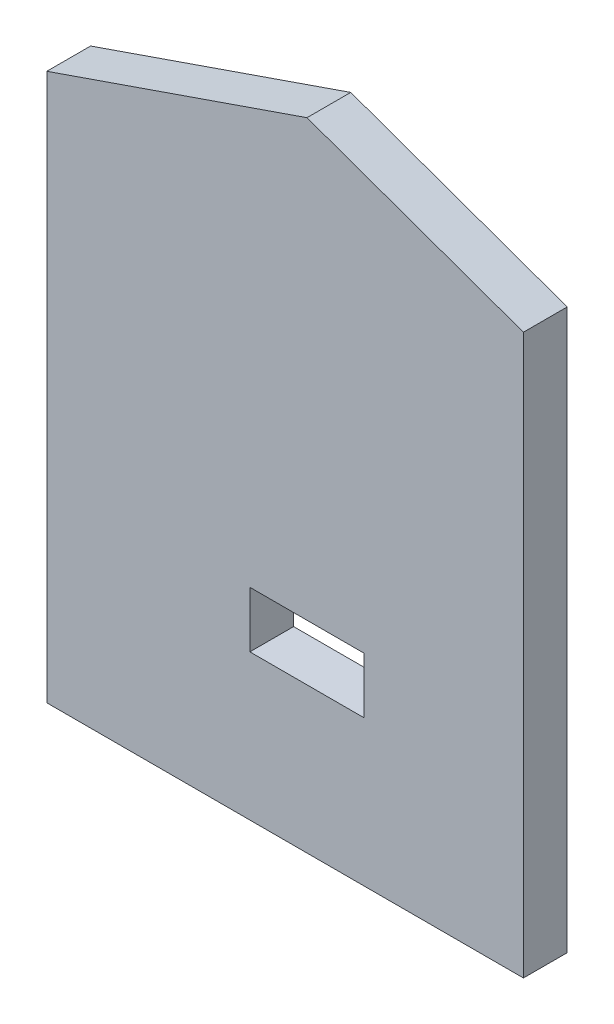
ISO-10303-21;
HEADER;
FILE_DESCRIPTION(('STEP AP214'),'2;1');
FILE_NAME('part.step','',(''),(''),'','','');
FILE_SCHEMA(('AUTOMOTIVE_DESIGN { 1 0 10303 214 1 1 1 1 }'));
ENDSEC;
DATA;
#1=APPLICATION_CONTEXT('core data for automotive mechanical design processes');
#2=APPLICATION_PROTOCOL_DEFINITION('international standard','automotive_design',2000,#1);
#3=PRODUCT_CONTEXT('',#1,'mechanical');
#4=PRODUCT('Part','Part','',(#3));
#5=PRODUCT_RELATED_PRODUCT_CATEGORY('part','',(#4));
#6=PRODUCT_DEFINITION_FORMATION('','',#4);
#7=PRODUCT_DEFINITION_CONTEXT('part definition',#1,'design');
#8=PRODUCT_DEFINITION('design','',#6,#7);
#9=PRODUCT_DEFINITION_SHAPE('','',#8);
#10=(LENGTH_UNIT() NAMED_UNIT(*) SI_UNIT(.MILLI.,.METRE.));
#11=(NAMED_UNIT(*) PLANE_ANGLE_UNIT() SI_UNIT($,.RADIAN.));
#12=(NAMED_UNIT(*) SI_UNIT($,.STERADIAN.) SOLID_ANGLE_UNIT());
#13=UNCERTAINTY_MEASURE_WITH_UNIT(LENGTH_MEASURE(1.E-05),#10,'distance_accuracy_value','');
#14=(GEOMETRIC_REPRESENTATION_CONTEXT(3) GLOBAL_UNCERTAINTY_ASSIGNED_CONTEXT((#13)) GLOBAL_UNIT_ASSIGNED_CONTEXT((#10,
#11,#12)) REPRESENTATION_CONTEXT('',''));
#15=CARTESIAN_POINT('',(0.,0.,0.));
#16=DIRECTION('',(0.,0.,1.));
#17=DIRECTION('',(1.,0.,0.));
#18=AXIS2_PLACEMENT_3D('',#15,#16,#17);
#19=CARTESIAN_POINT('',(0.,82.9046513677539,18.));
#20=DIRECTION('',(0.,1.,0.));
#21=DIRECTION('',(0.,0.,1.));
#22=AXIS2_PLACEMENT_3D('',#19,#20,#21);
#23=PLANE('',#22);
#24=DIRECTION('',(1.,0.,0.));
#25=VECTOR('',#24,1.);
#26=CARTESIAN_POINT('',(0.,82.9046513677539,0.));
#27=LINE('',#26,#25);
#28=CARTESIAN_POINT('',(83.5,82.9046513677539,0.));
#29=VERTEX_POINT('',#28);
#30=CARTESIAN_POINT('',(130.5,82.9046513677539,0.));
#31=VERTEX_POINT('',#30);
#32=EDGE_CURVE('E149',#29,#31,#27,.T.);
#33=ORIENTED_EDGE('',*,*,#32,.T.);
#34=DIRECTION('',(0.,0.,-1.));
#35=VECTOR('',#34,1.);
#36=CARTESIAN_POINT('',(130.5,82.9046513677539,18.));
#37=LINE('',#36,#35);
#38=CARTESIAN_POINT('',(130.5,82.9046513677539,18.));
#39=VERTEX_POINT('',#38);
#40=EDGE_CURVE('E11',#39,#31,#37,.T.);
#41=ORIENTED_EDGE('',*,*,#40,.F.);
#42=DIRECTION('',(1.,0.,0.));
#43=VECTOR('',#42,1.);
#44=CARTESIAN_POINT('',(0.,82.9046513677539,18.));
#45=LINE('',#44,#43);
#46=CARTESIAN_POINT('',(83.5,82.9046513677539,18.));
#47=VERTEX_POINT('',#46);
#48=EDGE_CURVE('E121',#47,#39,#45,.T.);
#49=ORIENTED_EDGE('',*,*,#48,.F.);
#50=DIRECTION('',(0.,0.,-1.));
#51=VECTOR('',#50,1.);
#52=CARTESIAN_POINT('',(83.5,82.9046513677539,18.));
#53=LINE('',#52,#51);
#54=EDGE_CURVE('E54',#47,#29,#53,.T.);
#55=ORIENTED_EDGE('',*,*,#54,.T.);
#56=EDGE_LOOP('',(#33,#41,#49,#55));
#57=FACE_BOUND('',#56,.T.);
#58=ADVANCED_FACE('F35',(#57),#23,.F.);
#59=CARTESIAN_POINT('',(130.5,0.,18.));
#60=DIRECTION('',(1.,0.,0.));
#61=DIRECTION('',(0.,0.,-1.));
#62=AXIS2_PLACEMENT_3D('',#59,#60,#61);
#63=PLANE('',#62);
#64=DIRECTION('',(0.,-1.,0.));
#65=VECTOR('',#64,1.);
#66=CARTESIAN_POINT('',(130.5,0.,0.));
#67=LINE('',#66,#65);
#68=CARTESIAN_POINT('',(130.5,59.9046513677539,0.));
#69=VERTEX_POINT('',#68);
#70=EDGE_CURVE('E127',#31,#69,#67,.T.);
#71=ORIENTED_EDGE('',*,*,#70,.T.);
#72=DIRECTION('',(0.,0.,-1.));
#73=VECTOR('',#72,1.);
#74=CARTESIAN_POINT('',(130.5,59.9046513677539,18.));
#75=LINE('',#74,#73);
#76=CARTESIAN_POINT('',(130.5,59.9046513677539,18.));
#77=VERTEX_POINT('',#76);
#78=EDGE_CURVE('E45',#77,#69,#75,.T.);
#79=ORIENTED_EDGE('',*,*,#78,.F.);
#80=DIRECTION('',(0.,-1.,0.));
#81=VECTOR('',#80,1.);
#82=CARTESIAN_POINT('',(130.5,0.,18.));
#83=LINE('',#82,#81);
#84=EDGE_CURVE('E115',#39,#77,#83,.T.);
#85=ORIENTED_EDGE('',*,*,#84,.F.);
#86=ORIENTED_EDGE('',*,*,#40,.T.);
#87=EDGE_LOOP('',(#71,#79,#85,#86));
#88=FACE_BOUND('',#87,.T.);
#89=ADVANCED_FACE('F126',(#88),#63,.F.);
#90=CARTESIAN_POINT('',(0.,59.9046513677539,18.));
#91=DIRECTION('',(0.,1.,0.));
#92=DIRECTION('',(0.,0.,1.));
#93=AXIS2_PLACEMENT_3D('',#90,#91,#92);
#94=PLANE('',#93);
#95=DIRECTION('',(1.,0.,0.));
#96=VECTOR('',#95,1.);
#97=CARTESIAN_POINT('',(0.,59.9046513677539,0.));
#98=LINE('',#97,#96);
#99=CARTESIAN_POINT('',(83.5000000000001,59.9046513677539,0.));
#100=VERTEX_POINT('',#99);
#101=EDGE_CURVE('E152',#100,#69,#98,.T.);
#102=ORIENTED_EDGE('',*,*,#101,.F.);
#103=DIRECTION('',(0.,0.,-1.));
#104=VECTOR('',#103,1.);
#105=CARTESIAN_POINT('',(83.5000000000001,59.9046513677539,18.));
#106=LINE('',#105,#104);
#107=CARTESIAN_POINT('',(83.5000000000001,59.9046513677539,18.));
#108=VERTEX_POINT('',#107);
#109=EDGE_CURVE('E83',#108,#100,#106,.T.);
#110=ORIENTED_EDGE('',*,*,#109,.F.);
#111=DIRECTION('',(1.,0.,0.));
#112=VECTOR('',#111,1.);
#113=CARTESIAN_POINT('',(0.,59.9046513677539,18.));
#114=LINE('',#113,#112);
#115=EDGE_CURVE('E120',#108,#77,#114,.T.);
#116=ORIENTED_EDGE('',*,*,#115,.T.);
#117=ORIENTED_EDGE('',*,*,#78,.T.);
#118=EDGE_LOOP('',(#102,#110,#116,#117));
#119=FACE_BOUND('',#118,.T.);
#120=ADVANCED_FACE('F131',(#119),#94,.T.);
#121=CARTESIAN_POINT('',(-69.4350127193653,200.936211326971,18.));
#122=DIRECTION('',(0.326607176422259,-0.94516017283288,0.));
#123=DIRECTION('',(0.94516017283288,0.32660717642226,0.));
#124=AXIS2_PLACEMENT_3D('',#121,#122,#123);
#125=PLANE('',#124);
#126=DIRECTION('',(-0.94516017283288,-0.32660717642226,0.));
#127=VECTOR('',#126,1.);
#128=CARTESIAN_POINT('',(-69.4350127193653,200.936211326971,0.));
#129=LINE('',#128,#127);
#130=CARTESIAN_POINT('',(107.,261.904651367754,0.));
#131=VERTEX_POINT('',#130);
#132=CARTESIAN_POINT('',(0.,224.93,0.));
#133=VERTEX_POINT('',#132);
#134=EDGE_CURVE('E138',#131,#133,#129,.T.);
#135=ORIENTED_EDGE('',*,*,#134,.T.);
#136=DIRECTION('',(0.,0.,-1.));
#137=VECTOR('',#136,1.);
#138=CARTESIAN_POINT('',(0.,224.93,18.));
#139=LINE('',#138,#137);
#140=CARTESIAN_POINT('',(0.,224.93,18.));
#141=VERTEX_POINT('',#140);
#142=EDGE_CURVE('E39',#141,#133,#139,.T.);
#143=ORIENTED_EDGE('',*,*,#142,.F.);
#144=DIRECTION('',(-0.94516017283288,-0.32660717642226,0.));
#145=VECTOR('',#144,1.);
#146=CARTESIAN_POINT('',(-69.4350127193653,200.936211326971,18.));
#147=LINE('',#146,#145);
#148=CARTESIAN_POINT('',(107.,261.904651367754,18.));
#149=VERTEX_POINT('',#148);
#150=EDGE_CURVE('E157',#149,#141,#147,.T.);
#151=ORIENTED_EDGE('',*,*,#150,.F.);
#152=DIRECTION('',(0.,0.,-1.));
#153=VECTOR('',#152,1.);
#154=CARTESIAN_POINT('',(107.,261.904651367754,18.));
#155=LINE('',#154,#153);
#156=EDGE_CURVE('E134',#149,#131,#155,.T.);
#157=ORIENTED_EDGE('',*,*,#156,.T.);
#158=EDGE_LOOP('',(#135,#143,#151,#157));
#159=FACE_BOUND('',#158,.T.);
#160=ADVANCED_FACE('F37',(#159),#125,.F.);
#161=CARTESIAN_POINT('',(0.,0.,18.));
#162=DIRECTION('',(1.,0.,0.));
#163=DIRECTION('',(0.,1.,0.));
#164=AXIS2_PLACEMENT_3D('',#161,#162,#163);
#165=PLANE('',#164);
#166=DIRECTION('',(0.,-1.,0.));
#167=VECTOR('',#166,1.);
#168=CARTESIAN_POINT('',(0.,0.,0.));
#169=LINE('',#168,#167);
#170=CARTESIAN_POINT('',(0.,0.,0.));
#171=VERTEX_POINT('',#170);
#172=EDGE_CURVE('E141',#133,#171,#169,.T.);
#173=ORIENTED_EDGE('',*,*,#172,.T.);
#174=DIRECTION('',(0.,0.,-1.));
#175=VECTOR('',#174,1.);
#176=CARTESIAN_POINT('',(0.,0.,18.));
#177=LINE('',#176,#175);
#178=CARTESIAN_POINT('',(0.,0.,18.));
#179=VERTEX_POINT('',#178);
#180=EDGE_CURVE('E167',#179,#171,#177,.T.);
#181=ORIENTED_EDGE('',*,*,#180,.F.);
#182=DIRECTION('',(0.,-1.,0.));
#183=VECTOR('',#182,1.);
#184=CARTESIAN_POINT('',(0.,0.,18.));
#185=LINE('',#184,#183);
#186=EDGE_CURVE('E96',#141,#179,#185,.T.);
#187=ORIENTED_EDGE('',*,*,#186,.F.);
#188=ORIENTED_EDGE('',*,*,#142,.T.);
#189=EDGE_LOOP('',(#173,#181,#187,#188));
#190=FACE_BOUND('',#189,.T.);
#191=ADVANCED_FACE('F173',(#190),#165,.F.);
#192=CARTESIAN_POINT('',(0.,0.,18.));
#193=DIRECTION('',(0.,1.,0.));
#194=DIRECTION('',(0.,0.,1.));
#195=AXIS2_PLACEMENT_3D('',#192,#193,#194);
#196=PLANE('',#195);
#197=DIRECTION('',(1.,0.,0.));
#198=VECTOR('',#197,1.);
#199=CARTESIAN_POINT('',(0.,0.,0.));
#200=LINE('',#199,#198);
#201=CARTESIAN_POINT('',(196.,0.,0.));
#202=VERTEX_POINT('',#201);
#203=EDGE_CURVE('E143',#171,#202,#200,.T.);
#204=ORIENTED_EDGE('',*,*,#203,.T.);
#205=DIRECTION('',(0.,0.,-1.));
#206=VECTOR('',#205,1.);
#207=CARTESIAN_POINT('',(196.,0.,18.));
#208=LINE('',#207,#206);
#209=CARTESIAN_POINT('',(196.,0.,18.));
#210=VERTEX_POINT('',#209);
#211=EDGE_CURVE('E165',#210,#202,#208,.T.);
#212=ORIENTED_EDGE('',*,*,#211,.F.);
#213=DIRECTION('',(1.,0.,0.));
#214=VECTOR('',#213,1.);
#215=CARTESIAN_POINT('',(0.,0.,18.));
#216=LINE('',#215,#214);
#217=EDGE_CURVE('E193',#179,#210,#216,.T.);
#218=ORIENTED_EDGE('',*,*,#217,.F.);
#219=ORIENTED_EDGE('',*,*,#180,.T.);
#220=EDGE_LOOP('',(#204,#212,#218,#219));
#221=FACE_BOUND('',#220,.T.);
#222=ADVANCED_FACE('F184',(#221),#196,.F.);
#223=CARTESIAN_POINT('',(196.,0.,18.));
#224=DIRECTION('',(-1.,0.,0.));
#225=DIRECTION('',(0.,0.,1.));
#226=AXIS2_PLACEMENT_3D('',#223,#224,#225);
#227=PLANE('',#226);
#228=DIRECTION('',(0.,1.,0.));
#229=VECTOR('',#228,1.);
#230=CARTESIAN_POINT('',(196.,0.,0.));
#231=LINE('',#230,#229);
#232=CARTESIAN_POINT('',(196.,230.,0.));
#233=VERTEX_POINT('',#232);
#234=EDGE_CURVE('E145',#202,#233,#231,.T.);
#235=ORIENTED_EDGE('',*,*,#234,.T.);
#236=DIRECTION('',(0.,0.,-1.));
#237=VECTOR('',#236,1.);
#238=CARTESIAN_POINT('',(196.,230.,18.));
#239=LINE('',#238,#237);
#240=CARTESIAN_POINT('',(196.,230.,18.));
#241=VERTEX_POINT('',#240);
#242=EDGE_CURVE('E162',#241,#233,#239,.T.);
#243=ORIENTED_EDGE('',*,*,#242,.F.);
#244=DIRECTION('',(0.,1.,0.));
#245=VECTOR('',#244,1.);
#246=CARTESIAN_POINT('',(196.,0.,18.));
#247=LINE('',#246,#245);
#248=EDGE_CURVE('E189',#210,#241,#247,.T.);
#249=ORIENTED_EDGE('',*,*,#248,.F.);
#250=ORIENTED_EDGE('',*,*,#211,.T.);
#251=EDGE_LOOP('',(#235,#243,#249,#250));
#252=FACE_BOUND('',#251,.T.);
#253=ADVANCED_FACE('F187',(#252),#227,.F.);
#254=CARTESIAN_POINT('',(95.3805608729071,266.069978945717,18.));
#255=DIRECTION('',(-0.337451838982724,-0.941342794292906,0.));
#256=DIRECTION('',(0.941342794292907,-0.337451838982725,0.));
#257=AXIS2_PLACEMENT_3D('',#254,#255,#256);
#258=PLANE('',#257);
#259=DIRECTION('',(-0.941342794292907,0.337451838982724,0.));
#260=VECTOR('',#259,1.);
#261=CARTESIAN_POINT('',(95.3805608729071,266.069978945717,0.));
#262=LINE('',#261,#260);
#263=EDGE_CURVE('E147',#233,#131,#262,.T.);
#264=ORIENTED_EDGE('',*,*,#263,.T.);
#265=ORIENTED_EDGE('',*,*,#156,.F.);
#266=DIRECTION('',(-0.941342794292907,0.337451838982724,0.));
#267=VECTOR('',#266,1.);
#268=CARTESIAN_POINT('',(95.3805608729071,266.069978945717,18.));
#269=LINE('',#268,#267);
#270=EDGE_CURVE('E192',#241,#149,#269,.T.);
#271=ORIENTED_EDGE('',*,*,#270,.F.);
#272=ORIENTED_EDGE('',*,*,#242,.T.);
#273=EDGE_LOOP('',(#264,#265,#271,#272));
#274=FACE_BOUND('',#273,.T.);
#275=ADVANCED_FACE('F200',(#274),#258,.F.);
#276=CARTESIAN_POINT('',(83.5000000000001,0.,18.));
#277=DIRECTION('',(1.,0.,0.));
#278=DIRECTION('',(0.,1.,0.));
#279=AXIS2_PLACEMENT_3D('',#276,#277,#278);
#280=PLANE('',#279);
#281=DIRECTION('',(0.,-1.,0.));
#282=VECTOR('',#281,1.);
#283=CARTESIAN_POINT('',(83.5000000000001,0.,0.));
#284=LINE('',#283,#282);
#285=EDGE_CURVE('E154',#29,#100,#284,.T.);
#286=ORIENTED_EDGE('',*,*,#285,.F.);
#287=ORIENTED_EDGE('',*,*,#54,.F.);
#288=DIRECTION('',(0.,-1.,0.));
#289=VECTOR('',#288,1.);
#290=CARTESIAN_POINT('',(83.5000000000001,0.,18.));
#291=LINE('',#290,#289);
#292=EDGE_CURVE('E132',#47,#108,#291,.T.);
#293=ORIENTED_EDGE('',*,*,#292,.T.);
#294=ORIENTED_EDGE('',*,*,#109,.T.);
#295=EDGE_LOOP('',(#286,#287,#293,#294));
#296=FACE_BOUND('',#295,.T.);
#297=ADVANCED_FACE('F202',(#296),#280,.T.);
#298=CARTESIAN_POINT('',(0.,0.,18.));
#299=DIRECTION('',(0.,0.,1.));
#300=DIRECTION('',(1.,0.,0.));
#301=AXIS2_PLACEMENT_3D('',#298,#299,#300);
#302=PLANE('',#301);
#303=ORIENTED_EDGE('',*,*,#150,.T.);
#304=ORIENTED_EDGE('',*,*,#186,.T.);
#305=ORIENTED_EDGE('',*,*,#217,.T.);
#306=ORIENTED_EDGE('',*,*,#248,.T.);
#307=ORIENTED_EDGE('',*,*,#270,.T.);
#308=EDGE_LOOP('',(#303,#304,#305,#306,#307));
#309=FACE_BOUND('',#308,.T.);
#310=ORIENTED_EDGE('',*,*,#48,.T.);
#311=ORIENTED_EDGE('',*,*,#84,.T.);
#312=ORIENTED_EDGE('',*,*,#115,.F.);
#313=ORIENTED_EDGE('',*,*,#292,.F.);
#314=EDGE_LOOP('',(#310,#311,#312,#313));
#315=FACE_BOUND('',#314,.T.);
#316=ADVANCED_FACE('F117',(#309,#315),#302,.T.);
#317=CARTESIAN_POINT('',(0.,0.,0.));
#318=DIRECTION('',(0.,0.,1.));
#319=DIRECTION('',(1.,0.,0.));
#320=AXIS2_PLACEMENT_3D('',#317,#318,#319);
#321=PLANE('',#320);
#322=ORIENTED_EDGE('',*,*,#134,.F.);
#323=ORIENTED_EDGE('',*,*,#263,.F.);
#324=ORIENTED_EDGE('',*,*,#234,.F.);
#325=ORIENTED_EDGE('',*,*,#203,.F.);
#326=ORIENTED_EDGE('',*,*,#172,.F.);
#327=EDGE_LOOP('',(#322,#323,#324,#325,#326));
#328=FACE_BOUND('',#327,.T.);
#329=ORIENTED_EDGE('',*,*,#32,.F.);
#330=ORIENTED_EDGE('',*,*,#285,.T.);
#331=ORIENTED_EDGE('',*,*,#101,.T.);
#332=ORIENTED_EDGE('',*,*,#70,.F.);
#333=EDGE_LOOP('',(#329,#330,#331,#332));
#334=FACE_BOUND('',#333,.T.);
#335=ADVANCED_FACE('F180',(#328,#334),#321,.F.);
#336=CLOSED_SHELL('',(#58,#89,#120,#160,#191,#222,#253,#275,#297,#316,#335));
#337=MANIFOLD_SOLID_BREP('B2',#336);
#338=ADVANCED_BREP_SHAPE_REPRESENTATION('',(#18,#337),#14);
#339=SHAPE_DEFINITION_REPRESENTATION(#9,#338);
ENDSEC;
END-ISO-10303-21;
